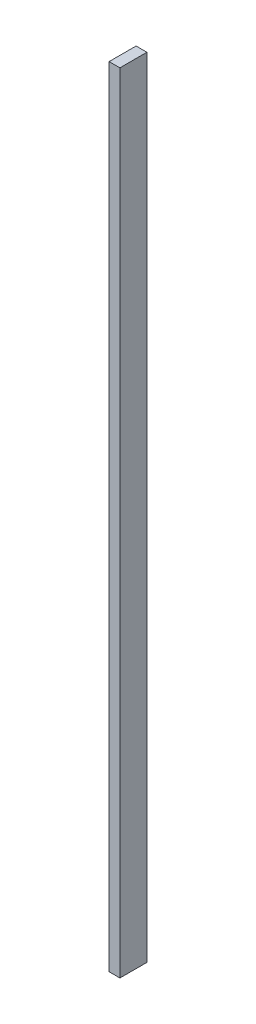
from build123d import *

# Parameters (mm, degrees)
ESQUISSE1_W      = 20
ESQUISSE1_H      = 50
EXTRUSION1_DEPTH = 1460


with BuildPart() as part:
    # Esquisse1 → Extrusion1 (new body)
    with BuildSketch(Plane(origin=(0, 0, 0), x_dir=(1, 0, 0), z_dir=(0, 1, 0))):
        with Locations((10, 25)):
            Rectangle(ESQUISSE1_W, ESQUISSE1_H)
    extrude(amount=EXTRUSION1_DEPTH)


solid = part.part
